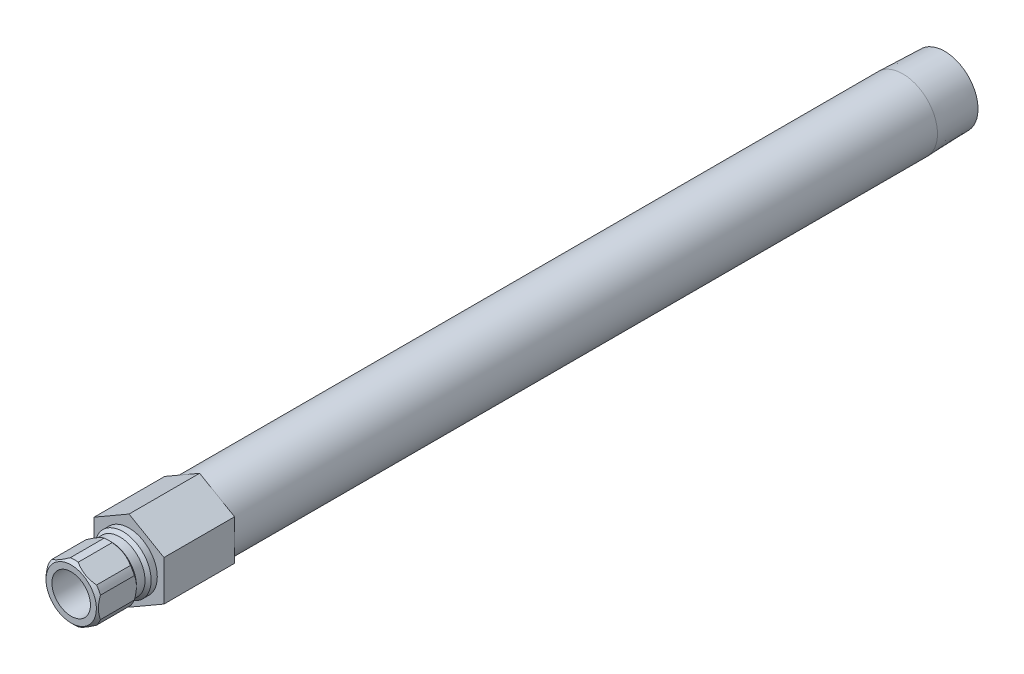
from build123d import *

# Parameters (mm, degrees)
SKETCH2_R           = 4.7625
BOSS_EXTRUDE1_DEPTH = 17.4498
CUT_EXTRUDE1_START  = 4.3942
SKETCH3_OUTSIDE_W   = 62.774
SKETCH3_OUTSIDE_H   = 65.446
CUT_EXTRUDE1_DEPTH  = 198.636739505


with BuildPart() as part:
    # Sketch1 → Revolve1 (revolve)
    with BuildSketch(Plane(origin=(0, 0, 0), x_dir=(0, 0, -1), z_dir=(1, 0, 0))):
        Polygon((-14.3002, 4.7625), (-14.3002, 6.223), (-13.5382, 6.985), (-5.1562, 6.985), (-4.3942, 6.223), (-2.27076, 6.223), (-1.50876, 6.985), (3.175, 6.985), (3.175, 8.5725), (191.262, 8.5725), (201.5998, 8.249445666), (201.5998, 6.2611), (17.4498, 6.2611), (17.4498, 4.7625), align=None)
    revolve(axis=Axis((0, 0, 0), (0, 0, 1)))

    # Sketch2 → Boss-Extrude1 (add)
    with BuildSketch(Plane.XY):
        Polygon((-8.636, 4.985996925), (-8.636, -4.985996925), (0, -9.971993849), (8.636, -4.985996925), (8.636, 4.985996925), (0, 9.971993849), align=None)
        with Locations(Location((0, 0, 0), (0, 0, 90))):
            Circle(SKETCH2_R, mode=Mode.SUBTRACT)
    extrude(amount=-BOSS_EXTRUDE1_DEPTH)

    # Sketch3 outside → Cut-Extrude1 (cut, through all)
    with BuildSketch(Plane.XY.offset(CUT_EXTRUDE1_START)):
        Rectangle(SKETCH3_OUTSIDE_W, SKETCH3_OUTSIDE_H)
        Polygon((6.477, -3.739497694), (6.477, 3.739497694), (0, 7.478995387), (-6.477, 3.739497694), (-6.477, -3.739497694), (0, -7.478995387), align=None, mode=Mode.SUBTRACT)
    extrude(amount=CUT_EXTRUDE1_DEPTH, mode=Mode.SUBTRACT)


solid = part.part
